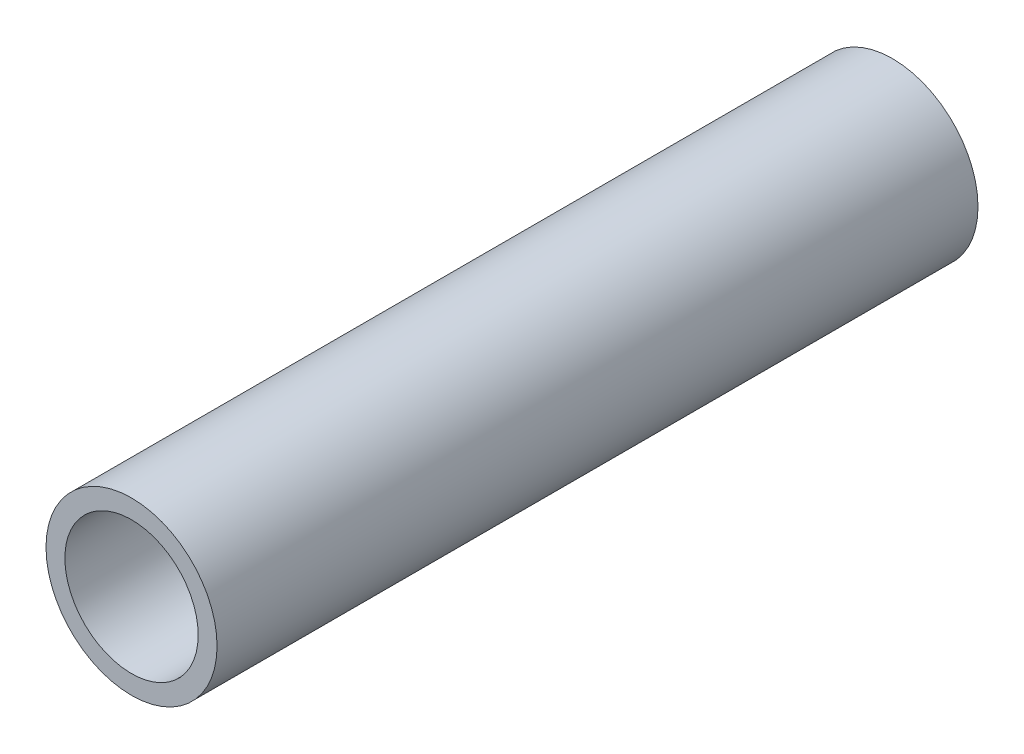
ISO-10303-21;
HEADER;
FILE_DESCRIPTION(('STEP AP214'),'2;1');
FILE_NAME('part.step','',(''),(''),'','','');
FILE_SCHEMA(('AUTOMOTIVE_DESIGN { 1 0 10303 214 1 1 1 1 }'));
ENDSEC;
DATA;
#1=APPLICATION_CONTEXT('core data for automotive mechanical design processes');
#2=APPLICATION_PROTOCOL_DEFINITION('international standard','automotive_design',2000,#1);
#3=PRODUCT_CONTEXT('',#1,'mechanical');
#4=PRODUCT('Part','Part','',(#3));
#5=PRODUCT_RELATED_PRODUCT_CATEGORY('part','',(#4));
#6=PRODUCT_DEFINITION_FORMATION('','',#4);
#7=PRODUCT_DEFINITION_CONTEXT('part definition',#1,'design');
#8=PRODUCT_DEFINITION('design','',#6,#7);
#9=PRODUCT_DEFINITION_SHAPE('','',#8);
#10=(LENGTH_UNIT() NAMED_UNIT(*) SI_UNIT(.MILLI.,.METRE.));
#11=(NAMED_UNIT(*) PLANE_ANGLE_UNIT() SI_UNIT($,.RADIAN.));
#12=(NAMED_UNIT(*) SI_UNIT($,.STERADIAN.) SOLID_ANGLE_UNIT());
#13=UNCERTAINTY_MEASURE_WITH_UNIT(LENGTH_MEASURE(1.E-05),#10,'distance_accuracy_value','');
#14=(GEOMETRIC_REPRESENTATION_CONTEXT(3) GLOBAL_UNCERTAINTY_ASSIGNED_CONTEXT((#13)) GLOBAL_UNIT_ASSIGNED_CONTEXT((#10,
#11,#12)) REPRESENTATION_CONTEXT('',''));
#15=CARTESIAN_POINT('',(0.,0.,0.));
#16=DIRECTION('',(0.,0.,1.));
#17=DIRECTION('',(1.,0.,0.));
#18=AXIS2_PLACEMENT_3D('',#15,#16,#17);
#19=CARTESIAN_POINT('',(0.,0.,63.4999999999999));
#20=DIRECTION('',(0.,0.,1.));
#21=DIRECTION('',(1.,0.,0.));
#22=AXIS2_PLACEMENT_3D('',#19,#20,#21);
#23=PLANE('',#22);
#24=CARTESIAN_POINT('',(0.,0.,63.4999999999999));
#25=DIRECTION('',(0.,0.,1.));
#26=DIRECTION('',(1.,0.,0.));
#27=AXIS2_PLACEMENT_3D('',#24,#25,#26);
#28=CIRCLE('',#27,7.1374);
#29=CARTESIAN_POINT('',(7.1374,0.,63.4999999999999));
#30=VERTEX_POINT('',#29);
#31=EDGE_CURVE('E11',#30,#30,#28,.T.);
#32=ORIENTED_EDGE('',*,*,#31,.T.);
#33=EDGE_LOOP('',(#32));
#34=FACE_BOUND('',#33,.T.);
#35=CARTESIAN_POINT('',(0.,0.,63.4999999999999));
#36=DIRECTION('',(0.,0.,1.));
#37=DIRECTION('',(1.,0.,0.));
#38=AXIS2_PLACEMENT_3D('',#35,#36,#37);
#39=CIRCLE('',#38,5.5626);
#40=CARTESIAN_POINT('',(5.5626,0.,63.4999999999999));
#41=VERTEX_POINT('',#40);
#42=EDGE_CURVE('E49',#41,#41,#39,.T.);
#43=ORIENTED_EDGE('',*,*,#42,.F.);
#44=EDGE_LOOP('',(#43));
#45=FACE_BOUND('',#44,.T.);
#46=ADVANCED_FACE('F38',(#34,#45),#23,.T.);
#47=CARTESIAN_POINT('',(0.,0.,0.));
#48=DIRECTION('',(0.,0.,1.));
#49=DIRECTION('',(1.,0.,0.));
#50=AXIS2_PLACEMENT_3D('',#47,#48,#49);
#51=PLANE('',#50);
#52=CARTESIAN_POINT('',(0.,0.,0.));
#53=DIRECTION('',(0.,0.,1.));
#54=DIRECTION('',(1.,0.,0.));
#55=AXIS2_PLACEMENT_3D('',#52,#53,#54);
#56=CIRCLE('',#55,7.1374);
#57=CARTESIAN_POINT('',(7.1374,0.,0.));
#58=VERTEX_POINT('',#57);
#59=EDGE_CURVE('E42',#58,#58,#56,.T.);
#60=ORIENTED_EDGE('',*,*,#59,.F.);
#61=EDGE_LOOP('',(#60));
#62=FACE_BOUND('',#61,.T.);
#63=CARTESIAN_POINT('',(0.,0.,0.));
#64=DIRECTION('',(0.,0.,1.));
#65=DIRECTION('',(1.,0.,0.));
#66=AXIS2_PLACEMENT_3D('',#63,#64,#65);
#67=CIRCLE('',#66,5.5626);
#68=CARTESIAN_POINT('',(5.5626,0.,0.));
#69=VERTEX_POINT('',#68);
#70=EDGE_CURVE('E51',#69,#69,#67,.T.);
#71=ORIENTED_EDGE('',*,*,#70,.T.);
#72=EDGE_LOOP('',(#71));
#73=FACE_BOUND('',#72,.T.);
#74=ADVANCED_FACE('F61',(#62,#73),#51,.F.);
#75=CARTESIAN_POINT('',(0.,0.,63.4999999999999));
#76=DIRECTION('',(0.,0.,-1.));
#77=DIRECTION('',(-1.,0.,0.));
#78=AXIS2_PLACEMENT_3D('',#75,#76,#77);
#79=CYLINDRICAL_SURFACE('',#78,7.1374);
#80=ORIENTED_EDGE('',*,*,#31,.F.);
#81=EDGE_LOOP('',(#80));
#82=FACE_BOUND('',#81,.T.);
#83=ORIENTED_EDGE('',*,*,#59,.T.);
#84=EDGE_LOOP('',(#83));
#85=FACE_BOUND('',#84,.T.);
#86=ADVANCED_FACE('F40',(#82,#85),#79,.T.);
#87=CARTESIAN_POINT('',(0.,0.,63.4999999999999));
#88=DIRECTION('',(0.,0.,-1.));
#89=DIRECTION('',(-1.,0.,0.));
#90=AXIS2_PLACEMENT_3D('',#87,#88,#89);
#91=CYLINDRICAL_SURFACE('',#90,5.5626);
#92=ORIENTED_EDGE('',*,*,#42,.T.);
#93=EDGE_LOOP('',(#92));
#94=FACE_BOUND('',#93,.T.);
#95=ORIENTED_EDGE('',*,*,#70,.F.);
#96=EDGE_LOOP('',(#95));
#97=FACE_BOUND('',#96,.T.);
#98=ADVANCED_FACE('F57',(#94,#97),#91,.F.);
#99=CLOSED_SHELL('',(#46,#74,#86,#98));
#100=MANIFOLD_SOLID_BREP('B2',#99);
#101=ADVANCED_BREP_SHAPE_REPRESENTATION('',(#18,#100),#14);
#102=SHAPE_DEFINITION_REPRESENTATION(#9,#101);
ENDSEC;
END-ISO-10303-21;
